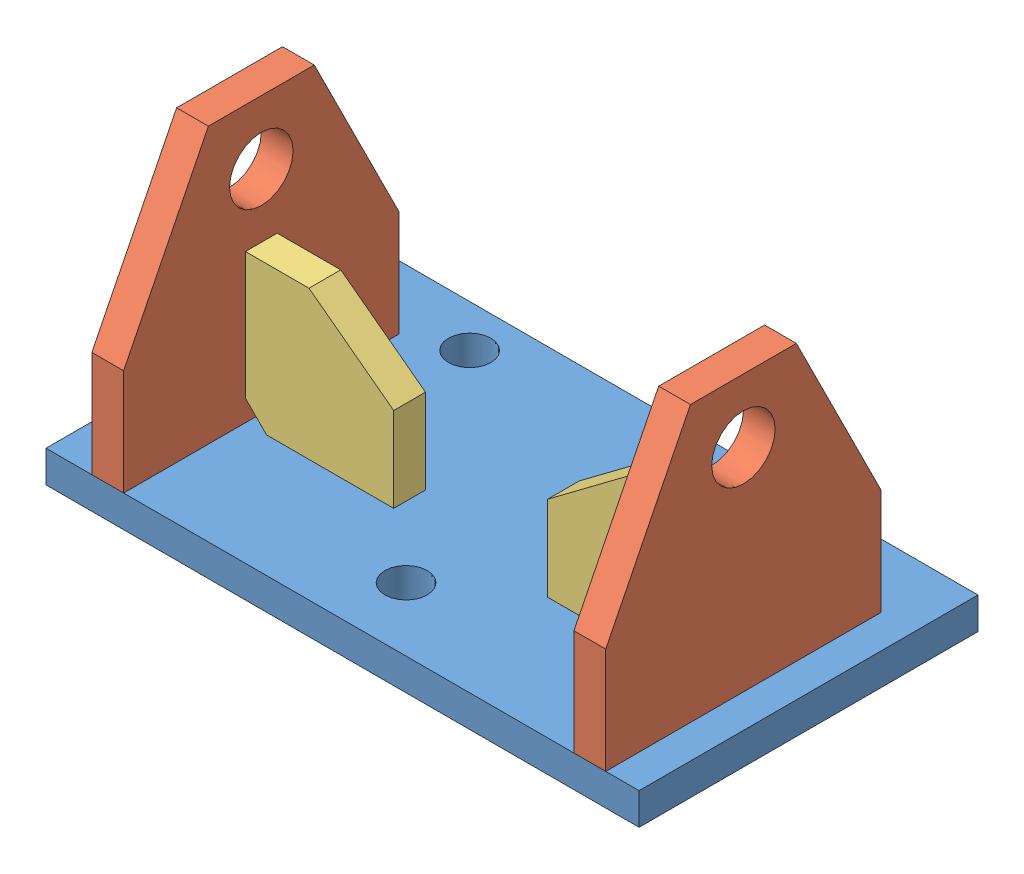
SolidWorks assembly Mates_&.SLDASM, configuration Default (file format 8000). Lengths in mm.
Overall size (177.8 92.08 101.6).
5 component instances, 3 part files, 12 mates.
Components (placement in the parent):
- RectBase_&-1: RectBase_&.SLDPRT [Default] at origin size (177.8 9.53 101.6)
- EndConnect_&-1: EndConnect_&.SLDPRT [Default] at (69.375 9.525 9.525) x (0 0 -1) z (1 0 0) size (82.55 82.55 9.53)
- EndConnect_&-2: EndConnect_&.SLDPRT [Default] at (-65.625 9.525 9.525) x (0 0 1) z (-1 0 0) size (82.55 82.55 9.53)
- Brace_&-1: Brace_&.SLDPRT [Default] at (69.375 9.525 9.525) x (-1 0 0) z (0 -1 0) size (44.45 9.53 44.45)
- Brace_&-2: Brace_&.SLDPRT [Default] at (-65.625 9.525 9.525) x (1 0 0) z (0 -1 0) size (44.45 9.53 44.45)
Mates (geometry in assembly coordinates):
- Distance1: distance = 10 mm aligned: plane of EndConnect_&-1 through (78.9 9.525 -31.75) normal (1 0 0); plane of RectBase_&-1 through (88.9 9.525 -50.8) normal (1 0 0)
- Coincident2: coincident anti-aligned: plane of RectBase_&-1 through (-88.9 9.525 50.8) normal (0 1 0); plane of EndConnect_&-1 through (78.9 9.525 -31.75) normal (0 -1 0)
- Coincident3: coincident aligned: plane of RectBase_&-1 through (-88.9 9.525 50.8) normal (0 0 1); plane of EndConnect_&-1 through (78.9 41.275 50.8) normal (0 0 1)
- Coincident4: coincident aligned: plane of RectBase_&-1 through (-88.9 9.525 50.8) normal (0 0 1); plane of EndConnect_&-2 through (-75.15 41.275 50.8) normal (0 0 1)
- Distance2: distance = 135 mm anti-aligned: plane of EndConnect_&-2 through (-65.625 9.525 50.8) normal (1 0 0); plane of EndConnect_&-1 through (69.375 9.525 -31.75) normal (-1 0 0)
- Coincident6: coincident anti-aligned: plane of RectBase_&-1 through (-88.9 9.525 50.8) normal (0 1 0); plane of EndConnect_&-2 through (-75.15 9.525 50.8) normal (0 -1 0)
- Coincident7: coincident anti-aligned: plane of RectBase_&-1 through (-88.9 9.525 50.8) normal (0 1 0); plane of Brace_&-2 through (-65.625 9.525 14.2875) normal (0 -1 0)
- Coincident8: coincident anti-aligned: plane of EndConnect_&-2 through (-65.625 9.525 50.8) normal (1 0 0); plane of Brace_&-2 through (-65.625 9.525 14.2875) normal (-1 0 0)
- Coincident9: coincident anti-aligned: plane of RectBase_&-1 through (-88.9 9.525 50.8) normal (0 1 0); plane of Brace_&-1 through (69.375 9.525 4.7625) normal (0 -1 0)
- Coincident10: coincident anti-aligned: plane of EndConnect_&-1 through (69.375 9.525 -31.75) normal (-1 0 0); plane of Brace_&-1 through (69.375 9.525 4.7625) normal (1 0 0)
- Coincident11: coincident aligned: plane of Brace_&-1 through (69.375 9.525 14.2875) normal (0 0 1); plane of Brace_&-2 through (-65.625 9.525 14.2875) normal (0 0 1)
- Width1: width anti-aligned: plane of EndConnect_&-2 through (-75.15 41.275 50.8) normal (0 0 1); plane of EndConnect_&-2 through (-75.15 41.275 -31.75) normal (0 0 -1); plane of Brace_&-2 through (-65.625 9.525 4.7625) normal (0 0 -1); plane of Brace_&-2 through (-65.625 9.525 14.2875) normal (0 0 1)
